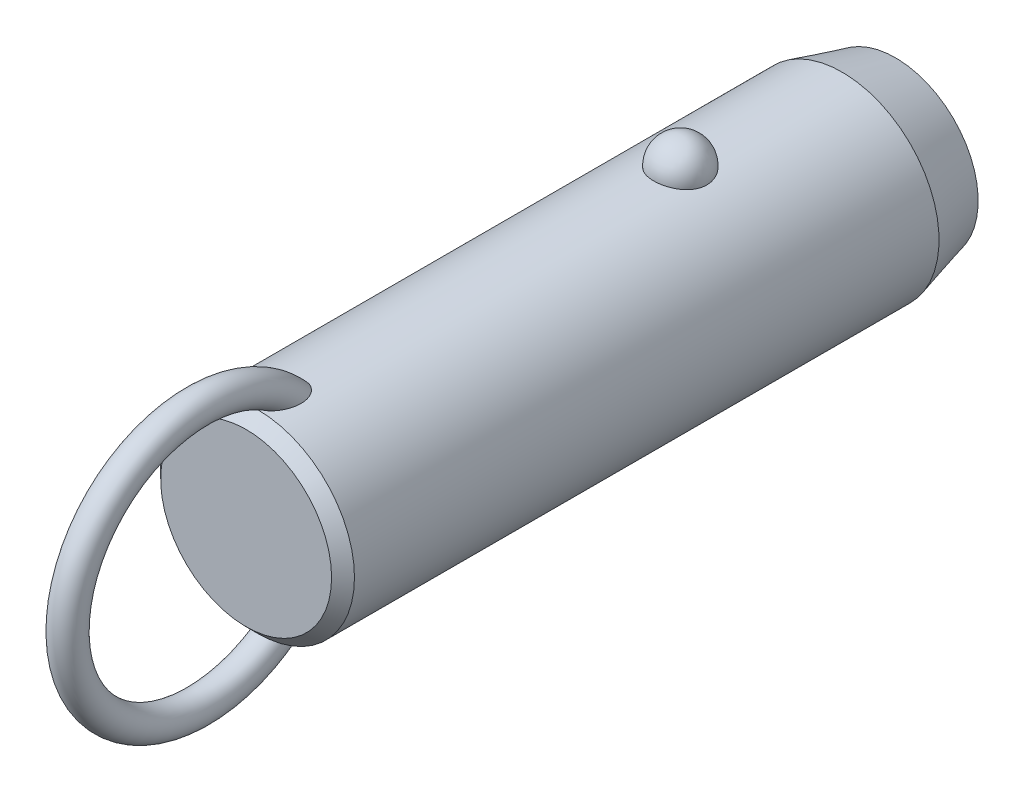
ISO-10303-21;
HEADER;
FILE_DESCRIPTION(('STEP AP214'),'2;1');
FILE_NAME('part.step','',(''),(''),'','','');
FILE_SCHEMA(('AUTOMOTIVE_DESIGN { 1 0 10303 214 1 1 1 1 }'));
ENDSEC;
DATA;
#1=APPLICATION_CONTEXT('core data for automotive mechanical design processes');
#2=APPLICATION_PROTOCOL_DEFINITION('international standard','automotive_design',2000,#1);
#3=PRODUCT_CONTEXT('',#1,'mechanical');
#4=PRODUCT('Part','Part','',(#3));
#5=PRODUCT_RELATED_PRODUCT_CATEGORY('part','',(#4));
#6=PRODUCT_DEFINITION_FORMATION('','',#4);
#7=PRODUCT_DEFINITION_CONTEXT('part definition',#1,'design');
#8=PRODUCT_DEFINITION('design','',#6,#7);
#9=PRODUCT_DEFINITION_SHAPE('','',#8);
#10=(LENGTH_UNIT() NAMED_UNIT(*) SI_UNIT(.MILLI.,.METRE.));
#11=(NAMED_UNIT(*) PLANE_ANGLE_UNIT() SI_UNIT($,.RADIAN.));
#12=(NAMED_UNIT(*) SI_UNIT($,.STERADIAN.) SOLID_ANGLE_UNIT());
#13=UNCERTAINTY_MEASURE_WITH_UNIT(LENGTH_MEASURE(1.E-05),#10,'distance_accuracy_value','');
#14=(GEOMETRIC_REPRESENTATION_CONTEXT(3) GLOBAL_UNCERTAINTY_ASSIGNED_CONTEXT((#13)) GLOBAL_UNIT_ASSIGNED_CONTEXT((#10,
#11,#12)) REPRESENTATION_CONTEXT('',''));
#15=CARTESIAN_POINT('',(0.,0.,0.));
#16=DIRECTION('',(0.,0.,1.));
#17=DIRECTION('',(1.,0.,0.));
#18=AXIS2_PLACEMENT_3D('',#15,#16,#17);
#19=CARTESIAN_POINT('',(0.,0.,40.7));
#20=DIRECTION('',(0.,0.,-1.));
#21=DIRECTION('',(-1.,0.,0.));
#22=AXIS2_PLACEMENT_3D('',#19,#20,#21);
#23=CYLINDRICAL_SURFACE('',#22,12.7);
#24=CARTESIAN_POINT('',(3.46661256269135,12.2177165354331,-3.5));
#25=CARTESIAN_POINT('',(3.4666090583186,12.2177194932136,-3.30432790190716));
#26=CARTESIAN_POINT('',(3.45063567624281,12.2222841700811,-3.10861112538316));
#27=CARTESIAN_POINT('',(3.38712451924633,12.2400345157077,-2.72271899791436));
#28=CARTESIAN_POINT('',(3.33957415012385,12.2532236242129,-2.53254588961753));
#29=CARTESIAN_POINT('',(3.2141234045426,12.286724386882,-2.16324948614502));
#30=CARTESIAN_POINT('',(3.13623639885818,12.3070329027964,-1.98412136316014));
#31=CARTESIAN_POINT('',(2.95205930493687,12.3525018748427,-1.64180592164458));
#32=CARTESIAN_POINT('',(2.84577003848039,12.3776621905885,-1.47861814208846));
#33=CARTESIAN_POINT('',(2.60688050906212,12.4301712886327,-1.17190583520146));
#34=CARTESIAN_POINT('',(2.47415697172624,12.4575299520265,-1.02847897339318));
#35=CARTESIAN_POINT('',(2.18615174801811,12.5112810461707,-0.766177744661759));
#36=CARTESIAN_POINT('',(2.03087002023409,12.5376734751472,-0.647303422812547));
#37=CARTESIAN_POINT('',(1.70237334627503,12.5864761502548,-0.437732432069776));
#38=CARTESIAN_POINT('',(1.52920948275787,12.6088972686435,-0.346958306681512));
#39=CARTESIAN_POINT('',(1.16944170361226,12.6473352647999,-0.195750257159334));
#40=CARTESIAN_POINT('',(0.982839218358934,12.663352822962,-0.135313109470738));
#41=CARTESIAN_POINT('',(0.604961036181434,12.6869706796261,-0.0473241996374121));
#42=CARTESIAN_POINT('',(0.41382314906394,12.6947125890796,-0.0192185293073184));
#43=CARTESIAN_POINT('',(0.0293827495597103,12.7014203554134,0.00517254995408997));
#44=CARTESIAN_POINT('',(-0.163919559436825,12.7003870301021,0.00146092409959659));
#45=CARTESIAN_POINT('',(-0.544374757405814,12.689735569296,-0.0373939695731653));
#46=CARTESIAN_POINT('',(-0.731575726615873,12.6802364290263,-0.0721015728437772));
#47=CARTESIAN_POINT('',(-1.09733277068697,12.6538333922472,-0.171364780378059));
#48=CARTESIAN_POINT('',(-1.27588869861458,12.6369293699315,-0.235920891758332));
#49=CARTESIAN_POINT('',(-1.6204698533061,12.5973946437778,-0.393548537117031));
#50=CARTESIAN_POINT('',(-1.78641865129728,12.5747321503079,-0.486778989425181));
#51=CARTESIAN_POINT('',(-2.10030671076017,12.5261316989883,-0.699110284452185));
#52=CARTESIAN_POINT('',(-2.24824419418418,12.5001934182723,-0.818213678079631));
#53=CARTESIAN_POINT('',(-2.52491489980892,12.4472906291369,-1.08157124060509));
#54=CARTESIAN_POINT('',(-2.65324222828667,12.4203160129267,-1.22624992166));
#55=CARTESIAN_POINT('',(-2.88410007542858,12.3687509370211,-1.53528325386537));
#56=CARTESIAN_POINT('',(-2.98662883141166,12.3441606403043,-1.69963924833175));
#57=CARTESIAN_POINT('',(-3.16432417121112,12.2998199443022,-2.04548497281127));
#58=CARTESIAN_POINT('',(-3.23917525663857,12.2801261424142,-2.22714424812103));
#59=CARTESIAN_POINT('',(-3.35800573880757,12.248167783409,-2.6009138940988));
#60=CARTESIAN_POINT('',(-3.4019860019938,12.2359030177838,-2.79302397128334));
#61=CARTESIAN_POINT('',(-3.45784812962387,12.2202347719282,-3.18140279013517));
#62=CARTESIAN_POINT('',(-3.46986123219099,12.2167950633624,-3.37765118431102));
#63=CARTESIAN_POINT('',(-3.46186273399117,12.2190638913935,-3.76943689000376));
#64=CARTESIAN_POINT('',(-3.44185196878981,12.2247721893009,-3.96497421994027));
#65=CARTESIAN_POINT('',(-3.37048652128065,12.2446381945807,-4.34881728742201));
#66=CARTESIAN_POINT('',(-3.31928253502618,12.2587552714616,-4.53715319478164));
#67=CARTESIAN_POINT('',(-3.18693461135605,12.2938237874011,-4.90231727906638));
#68=CARTESIAN_POINT('',(-3.1057895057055,12.3147754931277,-5.07914500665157));
#69=CARTESIAN_POINT('',(-2.91506431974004,12.3613125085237,-5.41732059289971));
#70=CARTESIAN_POINT('',(-2.80533587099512,12.3869217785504,-5.57858147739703));
#71=CARTESIAN_POINT('',(-2.560414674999,12.4398525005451,-5.88013283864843));
#72=CARTESIAN_POINT('',(-2.42522099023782,12.4671740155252,-6.02042254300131));
#73=CARTESIAN_POINT('',(-2.1323357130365,12.5205965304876,-6.27662798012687));
#74=CARTESIAN_POINT('',(-1.97456596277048,12.5466928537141,-6.39245542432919));
#75=CARTESIAN_POINT('',(-1.64115839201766,12.5946384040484,-6.59583547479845));
#76=CARTESIAN_POINT('',(-1.46552179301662,12.6164879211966,-6.68339001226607));
#77=CARTESIAN_POINT('',(-1.10356050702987,12.6532533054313,-6.82682153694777));
#78=CARTESIAN_POINT('',(-0.9173913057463,12.6682500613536,-6.88306988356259));
#79=CARTESIAN_POINT('',(-0.537836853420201,12.6900288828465,-6.96386887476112));
#80=CARTESIAN_POINT('',(-0.344452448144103,12.6968119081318,-6.9884232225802));
#81=CARTESIAN_POINT('',(0.0402577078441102,12.7013667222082,-7.00496469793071));
#82=CARTESIAN_POINT('',(0.231556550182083,12.6993008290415,-6.99753844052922));
#83=CARTESIAN_POINT('',(0.610105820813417,12.6867505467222,-6.95166366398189));
#84=CARTESIAN_POINT('',(0.797356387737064,12.6762664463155,-6.91321620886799));
#85=CARTESIAN_POINT('',(1.16186657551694,12.6480587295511,-6.80658431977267));
#86=CARTESIAN_POINT('',(1.33915951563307,12.6303611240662,-6.73850666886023));
#87=CARTESIAN_POINT('',(1.67968518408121,12.5896027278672,-6.57450875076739));
#88=CARTESIAN_POINT('',(1.84291705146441,12.5665416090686,-6.47858678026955));
#89=CARTESIAN_POINT('',(2.15340192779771,12.5171072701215,-6.25982455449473));
#90=CARTESIAN_POINT('',(2.30037831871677,12.4906895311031,-6.13660186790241));
#91=CARTESIAN_POINT('',(2.5717412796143,12.4376567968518,-5.86739587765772));
#92=CARTESIAN_POINT('',(2.69612388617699,12.4110417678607,-5.72140858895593));
#93=CARTESIAN_POINT('',(2.92107785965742,12.360051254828,-5.40794137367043));
#94=CARTESIAN_POINT('',(3.02121329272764,12.3357209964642,-5.24014110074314));
#95=CARTESIAN_POINT('',(3.19236291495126,12.2925446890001,-4.8896986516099));
#96=CARTESIAN_POINT('',(3.26338839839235,12.2736965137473,-4.70706226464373));
#97=CARTESIAN_POINT('',(3.36788038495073,12.245404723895,-4.35469510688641));
#98=CARTESIAN_POINT('',(3.40484026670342,12.2351018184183,-4.18605935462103));
#99=CARTESIAN_POINT('',(3.45420764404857,12.2212564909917,-3.84496058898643));
#100=CARTESIAN_POINT('',(3.46661565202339,12.2177139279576,-3.67249765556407));
#101=CARTESIAN_POINT('',(3.46661256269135,12.2177165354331,-3.5));
#102=B_SPLINE_CURVE_WITH_KNOTS('',3,(#24,#25,#26,#27,#28,#29,#30,#31,#32,#33,#34,#35,#36,#37,
#38,#39,#40,#41,#42,#43,#44,#45,#46,#47,#48,#49,#50,#51,#52,#53,#54,#55,#56,#57,#58,#59,#60,#61,
#62,#63,#64,#65,#66,#67,#68,#69,#70,#71,#72,#73,#74,#75,#76,#77,#78,#79,#80,#81,#82,#83,#84,#85,
#86,#87,#88,#89,#90,#91,#92,#93,#94,#95,#96,#97,#98,#99,#100,#101),.UNSPECIFIED.,.T.,.F.,(4,2,2,
2,2,2,2,2,2,2,2,2,2,2,2,2,2,2,2,2,2,2,2,2,2,2,2,2,2,2,2,2,2,2,2,2,2,2,4),(0.,0.586396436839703,
1.17302689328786,1.7593990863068,2.34575431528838,2.93491084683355,3.52406845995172,
4.11158733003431,4.69904375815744,5.2762784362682,5.85345931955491,6.42265312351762,
6.99185659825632,7.56427334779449,8.136746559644,8.71981013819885,9.3029135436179,
9.89247258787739,10.4820150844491,11.0691335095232,11.6562366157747,12.2405256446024,
12.8248374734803,13.412244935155,13.9996740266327,14.5891883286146,15.1786623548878,
15.7609861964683,16.3432419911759,16.9148635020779,17.4864654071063,18.0560241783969,
18.6256177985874,19.2037609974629,19.7820055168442,20.3699810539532,20.957728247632,
21.4746855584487,21.9916320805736),.UNSPECIFIED.);
#103=CARTESIAN_POINT('',(3.46661256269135,12.2177165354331,-3.5));
#104=VERTEX_POINT('',#103);
#105=EDGE_CURVE('E41',#104,#104,#102,.T.);
#106=ORIENTED_EDGE('',*,*,#105,.T.);
#107=EDGE_LOOP('',(#106));
#108=FACE_BOUND('',#107,.T.);
#109=CARTESIAN_POINT('',(0.,0.,51.9));
#110=DIRECTION('',(0.,0.,1.));
#111=DIRECTION('',(1.,0.,0.));
#112=AXIS2_PLACEMENT_3D('',#109,#110,#111);
#113=CIRCLE('',#112,12.7);
#114=CARTESIAN_POINT('',(12.7,0.,51.9));
#115=VERTEX_POINT('',#114);
#116=EDGE_CURVE('E10',#115,#115,#113,.F.);
#117=ORIENTED_EDGE('',*,*,#116,.T.);
#118=EDGE_LOOP('',(#117));
#119=FACE_BOUND('',#118,.T.);
#120=CARTESIAN_POINT('',(-0.54812224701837,-12.6881662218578,45.6432187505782));
#121=CARTESIAN_POINT('',(-0.648865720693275,-12.6838128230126,45.677926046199));
#122=CARTESIAN_POINT('',(-0.746398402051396,-12.6783867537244,45.7220428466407));
#123=CARTESIAN_POINT('',(-0.932125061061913,-12.666091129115,45.8267647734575));
#124=CARTESIAN_POINT('',(-1.02030388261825,-12.6592192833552,45.887396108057));
#125=CARTESIAN_POINT('',(-1.18487740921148,-12.6448747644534,46.021847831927));
#126=CARTESIAN_POINT('',(-1.26134296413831,-12.637406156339,46.0955825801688));
#127=CARTESIAN_POINT('',(-1.4023120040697,-12.6225412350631,46.2536045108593));
#128=CARTESIAN_POINT('',(-1.46681470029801,-12.6151449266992,46.3378923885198));
#129=CARTESIAN_POINT('',(-1.60714786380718,-12.5981718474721,46.5496577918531));
#130=CARTESIAN_POINT('',(-1.67725126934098,-12.588900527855,46.6809624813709));
#131=CARTESIAN_POINT('',(-1.79536591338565,-12.5725964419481,46.9532471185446));
#132=CARTESIAN_POINT('',(-1.84333535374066,-12.5655679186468,47.0942447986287));
#133=CARTESIAN_POINT('',(-1.93422576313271,-12.5519624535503,47.4376455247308));
#134=CARTESIAN_POINT('',(-1.96788773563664,-12.5466298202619,47.6425578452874));
#135=CARTESIAN_POINT('',(-1.9941399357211,-12.542463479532,47.9517600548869));
#136=CARTESIAN_POINT('',(-1.99883864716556,-12.5417153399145,48.0552987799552));
#137=CARTESIAN_POINT('',(-2.00078003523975,-12.5414074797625,48.2624512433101));
#138=CARTESIAN_POINT('',(-1.99802449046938,-12.5418474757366,48.3660649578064));
#139=CARTESIAN_POINT('',(-1.98336733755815,-12.5441750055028,48.6103207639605));
#140=CARTESIAN_POINT('',(-1.96851430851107,-12.5465291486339,48.750780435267));
#141=CARTESIAN_POINT('',(-1.92707089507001,-12.5529612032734,49.0299607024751));
#142=CARTESIAN_POINT('',(-1.900474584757,-12.5570399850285,49.1686803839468));
#143=CARTESIAN_POINT('',(-1.83619120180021,-12.5666008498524,49.4434113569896));
#144=CARTESIAN_POINT('',(-1.79850828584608,-12.57208240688,49.5794236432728));
#145=CARTESIAN_POINT('',(-1.71223796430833,-12.5841228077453,49.8478421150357));
#146=CARTESIAN_POINT('',(-1.66365679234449,-12.5906810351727,49.9802503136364));
#147=CARTESIAN_POINT('',(-1.57804503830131,-12.6016176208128,50.1854887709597));
#148=CARTESIAN_POINT('',(-1.54477252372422,-12.6057501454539,50.2599149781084));
#149=CARTESIAN_POINT('',(-1.47424480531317,-12.6141930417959,50.4068393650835));
#150=CARTESIAN_POINT('',(-1.43699041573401,-12.6185033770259,50.4793379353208));
#151=CARTESIAN_POINT('',(-1.35825795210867,-12.6272207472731,50.6218926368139));
#152=CARTESIAN_POINT('',(-1.31678520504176,-12.6316276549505,50.6919517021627));
#153=CARTESIAN_POINT('',(-1.22917793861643,-12.6404532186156,50.8290705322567));
#154=CARTESIAN_POINT('',(-1.18304514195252,-12.6448718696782,50.8961313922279));
#155=CARTESIAN_POINT('',(-1.07246411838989,-12.6547893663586,51.0438741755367));
#156=CARTESIAN_POINT('',(-1.00642239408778,-12.6602600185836,51.1233844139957));
#157=CARTESIAN_POINT('',(-0.864441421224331,-12.6707460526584,51.2731698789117));
#158=CARTESIAN_POINT('',(-0.788516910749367,-12.6757620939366,51.3434585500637));
#159=CARTESIAN_POINT('',(-0.652215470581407,-12.6833591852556,51.4486801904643));
#160=CARTESIAN_POINT('',(-0.594982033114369,-12.6861973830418,51.4876241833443));
#161=CARTESIAN_POINT('',(-0.475269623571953,-12.6912445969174,51.5564899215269));
#162=CARTESIAN_POINT('',(-0.412800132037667,-12.6934547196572,51.5864275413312));
#163=CARTESIAN_POINT('',(-0.295749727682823,-12.6966636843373,51.6297565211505));
#164=CARTESIAN_POINT('',(-0.241949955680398,-12.6978134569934,51.6452188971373));
#165=CARTESIAN_POINT('',(-0.132508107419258,-12.6994261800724,51.6668845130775));
#166=CARTESIAN_POINT('',(-0.0768679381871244,-12.6998898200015,51.6730970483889));
#167=CARTESIAN_POINT('',(0.0347696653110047,-12.7000752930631,51.6755838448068));
#168=CARTESIAN_POINT('',(0.0907676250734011,-12.6997954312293,51.6718353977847));
#169=CARTESIAN_POINT('',(0.201283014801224,-12.6985255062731,51.6547883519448));
#170=CARTESIAN_POINT('',(0.255799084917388,-12.6975348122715,51.6414812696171));
#171=CARTESIAN_POINT('',(0.376042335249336,-12.6946091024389,51.6020379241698));
#172=CARTESIAN_POINT('',(0.440950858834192,-12.6924943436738,51.5734492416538));
#173=CARTESIAN_POINT('',(0.565350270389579,-12.6875639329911,51.5063234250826));
#174=CARTESIAN_POINT('',(0.624828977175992,-12.6847467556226,51.4677646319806));
#175=CARTESIAN_POINT('',(0.774116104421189,-12.6767252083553,51.356949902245));
#176=CARTESIAN_POINT('',(0.859449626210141,-12.6711344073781,51.2787605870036));
#177=CARTESIAN_POINT('',(1.01789440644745,-12.6593922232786,51.110943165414));
#178=CARTESIAN_POINT('',(1.09096902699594,-12.653239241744,51.021282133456));
#179=CARTESIAN_POINT('',(1.22268793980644,-12.6411674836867,50.8402658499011));
#180=CARTESIAN_POINT('',(1.28193986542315,-12.6352572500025,50.749345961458));
#181=CARTESIAN_POINT('',(1.39259777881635,-12.6235401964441,50.5627929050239));
#182=CARTESIAN_POINT('',(1.44399707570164,-12.6177334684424,50.4671558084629));
#183=CARTESIAN_POINT('',(1.53972870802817,-12.6064093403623,50.2722738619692));
#184=CARTESIAN_POINT('',(1.58405262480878,-12.6008922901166,50.1730248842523));
#185=CARTESIAN_POINT('',(1.66600705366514,-12.5903187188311,49.9717727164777));
#186=CARTESIAN_POINT('',(1.70363651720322,-12.5852622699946,49.8697690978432));
#187=CARTESIAN_POINT('',(1.7754537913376,-12.5753406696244,49.6543580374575));
#188=CARTESIAN_POINT('',(1.80903453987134,-12.5705328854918,49.5407454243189));
#189=CARTESIAN_POINT('',(1.86844163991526,-12.5618400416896,49.3114575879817));
#190=CARTESIAN_POINT('',(1.89426665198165,-12.5579551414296,49.1957820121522));
#191=CARTESIAN_POINT('',(1.93785464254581,-12.5513030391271,48.9630072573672));
#192=CARTESIAN_POINT('',(1.95562640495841,-12.5485346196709,48.8459097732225));
#193=CARTESIAN_POINT('',(1.98264463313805,-12.5442934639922,48.6107473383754));
#194=CARTESIAN_POINT('',(1.99189298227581,-12.5428204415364,48.4926826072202));
#195=CARTESIAN_POINT('',(2.00416068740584,-12.540871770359,48.1806225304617));
#196=CARTESIAN_POINT('',(1.99944433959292,-12.541631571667,47.986229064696));
#197=CARTESIAN_POINT('',(1.96113755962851,-12.5476846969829,47.6003095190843));
#198=CARTESIAN_POINT('',(1.92758341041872,-12.5529723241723,47.4087801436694));
#199=CARTESIAN_POINT('',(1.83934342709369,-12.5661532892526,47.0822728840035));
#200=CARTESIAN_POINT('',(1.79215440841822,-12.5730485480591,46.9452499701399));
#201=CARTESIAN_POINT('',(1.67676242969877,-12.588958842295,46.6804459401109));
#202=CARTESIAN_POINT('',(1.60859050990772,-12.597970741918,46.5526515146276));
#203=CARTESIAN_POINT('',(1.4658383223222,-12.6152829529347,46.3358006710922));
#204=CARTESIAN_POINT('',(1.39525727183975,-12.6233659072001,46.2441050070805));
#205=CARTESIAN_POINT('',(1.2399259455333,-12.6395676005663,46.0734854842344));
#206=CARTESIAN_POINT('',(1.15517932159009,-12.6476863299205,45.9945583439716));
#207=CARTESIAN_POINT('',(0.971995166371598,-12.6630846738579,45.8526438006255));
#208=CARTESIAN_POINT('',(0.873456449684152,-12.6703572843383,45.789784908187));
#209=CARTESIAN_POINT('',(0.665847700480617,-12.6829569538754,45.6844870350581));
#210=CARTESIAN_POINT('',(0.55678457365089,-12.688285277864,45.6420347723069));
#211=CARTESIAN_POINT('',(0.347338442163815,-12.6956226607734,45.5844434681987));
#212=CARTESIAN_POINT('',(0.247759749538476,-12.6979816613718,45.5663996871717));
#213=CARTESIAN_POINT('',(0.0470218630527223,-12.7003077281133,45.5486007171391));
#214=CARTESIAN_POINT('',(-0.0541350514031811,-12.7002779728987,45.5488212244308));
#215=CARTESIAN_POINT('',(-0.221414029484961,-12.6982482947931,45.5643639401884));
#216=CARTESIAN_POINT('',(-0.288055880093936,-12.6969033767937,45.5746662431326));
#217=CARTESIAN_POINT('',(-0.419599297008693,-12.6932369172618,45.6031348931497));
#218=CARTESIAN_POINT('',(-0.484501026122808,-12.6909154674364,45.6213005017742));
#219=CARTESIAN_POINT('',(-0.54812224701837,-12.6881662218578,45.6432187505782));
#220=B_SPLINE_CURVE_WITH_KNOTS('',3,(#120,#121,#122,#123,#124,#125,#126,#127,#128,#129,#130,
#131,#132,#133,#134,#135,#136,#137,#138,#139,#140,#141,#142,#143,#144,#145,#146,#147,#148,#149,
#150,#151,#152,#153,#154,#155,#156,#157,#158,#159,#160,#161,#162,#163,#164,#165,#166,#167,#168,
#169,#170,#171,#172,#173,#174,#175,#176,#177,#178,#179,#180,#181,#182,#183,#184,#185,#186,#187,
#188,#189,#190,#191,#192,#193,#194,#195,#196,#197,#198,#199,#200,#201,#202,#203,#204,#205,#206,
#207,#208,#209,#210,#211,#212,#213,#214,#215,#216,#217,#218,#219),.UNSPECIFIED.,.T.,.F.,(4,2,2,
2,2,2,2,2,2,2,2,2,2,2,2,2,2,2,2,2,2,2,2,2,2,2,2,2,2,2,2,2,2,2,2,2,2,2,2,2,2,2,2,2,2,2,2,2,2,4),
(0.,0.319642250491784,0.639794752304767,0.957927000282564,1.27608021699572,1.72100165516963,
2.16675988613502,2.78630021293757,3.09705782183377,3.40774128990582,3.83096358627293,
4.25439969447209,4.67767724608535,5.10071330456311,5.34550297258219,5.59024267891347,
5.8346770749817,6.07902143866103,6.38891080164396,6.69834321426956,6.90560910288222,
7.11250749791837,7.27977315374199,7.44687060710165,7.6143493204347,7.78197685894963,
7.99365544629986,8.20579780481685,8.551473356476,8.89816429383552,9.22375138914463,
9.54961437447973,9.87586224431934,10.202161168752,10.5575872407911,10.9130746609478,
11.2681734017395,11.6231936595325,12.2046601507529,12.7853961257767,13.219164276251,
13.6522938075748,13.9989174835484,14.3454519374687,14.6946768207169,15.0436740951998,
15.3457513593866,15.6474266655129,15.8493051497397,16.0511646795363),.UNSPECIFIED.);
#221=CARTESIAN_POINT('',(-0.54812224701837,-12.6881662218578,45.6432187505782));
#222=VERTEX_POINT('',#221);
#223=EDGE_CURVE('E59',#222,#222,#220,.T.);
#224=ORIENTED_EDGE('',*,*,#223,.T.);
#225=EDGE_LOOP('',(#224));
#226=FACE_BOUND('',#225,.T.);
#227=CARTESIAN_POINT('',(-0.54812224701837,12.6881662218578,45.6432187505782));
#228=CARTESIAN_POINT('',(-0.459436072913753,12.6919968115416,45.612673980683));
#229=CARTESIAN_POINT('',(-0.368189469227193,12.6949996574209,45.5893913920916));
#230=CARTESIAN_POINT('',(-0.183024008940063,12.6990186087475,45.5584062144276));
#231=CARTESIAN_POINT('',(-0.0891049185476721,12.7000345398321,45.5507049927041));
#232=CARTESIAN_POINT('',(0.098714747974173,12.6999636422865,45.5512455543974));
#233=CARTESIAN_POINT('',(0.192615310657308,12.6988761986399,45.5594920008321));
#234=CARTESIAN_POINT('',(0.377658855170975,12.6947211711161,45.5915515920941));
#235=CARTESIAN_POINT('',(0.468801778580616,12.6916535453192,45.6153650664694));
#236=CARTESIAN_POINT('',(0.645809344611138,12.6838788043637,45.6774565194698));
#237=CARTESIAN_POINT('',(0.731679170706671,12.6791733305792,45.715720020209));
#238=CARTESIAN_POINT('',(0.896315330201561,12.6686004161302,45.805120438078));
#239=CARTESIAN_POINT('',(0.975080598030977,12.6627328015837,45.8562592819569));
#240=CARTESIAN_POINT('',(1.12963655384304,12.6499161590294,45.9736782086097));
#241=CARTESIAN_POINT('',(1.20478673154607,12.6429194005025,46.0407929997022));
#242=CARTESIAN_POINT('',(1.34448241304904,12.6288282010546,46.1852250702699));
#243=CARTESIAN_POINT('',(1.40902173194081,12.621733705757,46.2625482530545));
#244=CARTESIAN_POINT('',(1.55208211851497,12.6050877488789,46.4592475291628));
#245=CARTESIAN_POINT('',(1.62510490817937,12.5957546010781,46.5826540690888));
#246=CARTESIAN_POINT('',(1.7501904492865,12.5789823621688,46.8397690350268));
#247=CARTESIAN_POINT('',(1.80221377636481,12.5715468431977,46.973496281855));
#248=CARTESIAN_POINT('',(1.90309965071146,12.5567434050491,47.2983516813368));
#249=CARTESIAN_POINT('',(1.94342317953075,12.5504515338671,47.4921611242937));
#250=CARTESIAN_POINT('',(1.99332997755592,12.5426147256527,47.8837881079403));
#251=CARTESIAN_POINT('',(2.00285305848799,12.5410790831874,48.0816127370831));
#252=CARTESIAN_POINT('',(1.99678999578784,12.5420407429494,48.4166427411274));
#253=CARTESIAN_POINT('',(1.98794117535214,12.5434564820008,48.5540428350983));
#254=CARTESIAN_POINT('',(1.95865119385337,12.5480641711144,48.8276394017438));
#255=CARTESIAN_POINT('',(1.9382043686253,12.5512569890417,48.9638352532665));
#256=CARTESIAN_POINT('',(1.88647896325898,12.5591352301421,49.2342493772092));
#257=CARTESIAN_POINT('',(1.85518800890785,12.5638223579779,49.3684652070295));
#258=CARTESIAN_POINT('',(1.78217886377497,12.5743868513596,49.6339362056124));
#259=CARTESIAN_POINT('',(1.74046509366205,12.5802637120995,49.7651926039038));
#260=CARTESIAN_POINT('',(1.66024095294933,12.5910571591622,49.9860855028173));
#261=CARTESIAN_POINT('',(1.62434772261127,12.5957535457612,50.0766904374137));
#262=CARTESIAN_POINT('',(1.5470900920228,12.6054762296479,50.2555125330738));
#263=CARTESIAN_POINT('',(1.50572681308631,12.6105024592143,50.3437301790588));
#264=CARTESIAN_POINT('',(1.41728020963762,12.620748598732,50.5169321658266));
#265=CARTESIAN_POINT('',(1.37021377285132,12.625967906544,50.6019251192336));
#266=CARTESIAN_POINT('',(1.2696962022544,12.6364721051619,50.7680072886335));
#267=CARTESIAN_POINT('',(1.21624929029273,12.6417569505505,50.8490990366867));
#268=CARTESIAN_POINT('',(1.10304413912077,12.6521331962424,51.0047027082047));
#269=CARTESIAN_POINT('',(1.04340936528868,12.657226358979,51.0793033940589));
#270=CARTESIAN_POINT('',(0.915919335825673,12.6670906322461,51.221324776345));
#271=CARTESIAN_POINT('',(0.848064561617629,12.6718617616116,51.2887458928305));
#272=CARTESIAN_POINT('',(0.717035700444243,12.67987711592,51.4006247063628));
#273=CARTESIAN_POINT('',(0.655526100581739,12.6832377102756,51.4469970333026));
#274=CARTESIAN_POINT('',(0.525985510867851,12.6892676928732,51.5296195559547));
#275=CARTESIAN_POINT('',(0.457969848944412,12.6919386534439,51.5658927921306));
#276=CARTESIAN_POINT('',(0.33485964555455,12.695691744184,51.6166572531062));
#277=CARTESIAN_POINT('',(0.281116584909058,12.6970073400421,51.6343733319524));
#278=CARTESIAN_POINT('',(0.171425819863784,12.6989609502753,51.6606429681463));
#279=CARTESIAN_POINT('',(0.115480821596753,12.699599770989,51.6692074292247));
#280=CARTESIAN_POINT('',(0.0027261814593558,12.7001251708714,51.6762531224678));
#281=CARTESIAN_POINT('',(-0.054085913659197,12.7000089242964,51.6746964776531));
#282=CARTESIAN_POINT('',(-0.166544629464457,12.6990328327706,51.6616005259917));
#283=CARTESIAN_POINT('',(-0.22219029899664,12.6981724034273,51.6500533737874));
#284=CARTESIAN_POINT('',(-0.342018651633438,12.695562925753,51.6149128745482));
#285=CARTESIAN_POINT('',(-0.405606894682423,12.6936676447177,51.5893322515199));
#286=CARTESIAN_POINT('',(-0.527815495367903,12.6891754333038,51.5283111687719));
#287=CARTESIAN_POINT('',(-0.586425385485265,12.6865770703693,51.4928505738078));
#288=CARTESIAN_POINT('',(-0.731842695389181,12.6792129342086,51.3914960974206));
#289=CARTESIAN_POINT('',(-0.814709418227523,12.6740767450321,51.3200395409));
#290=CARTESIAN_POINT('',(-0.969101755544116,12.6632083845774,51.1658900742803));
#291=CARTESIAN_POINT('',(-1.04059564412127,12.6574746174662,51.0831668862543));
#292=CARTESIAN_POINT('',(-1.1698111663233,12.6461638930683,50.9158096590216));
#293=CARTESIAN_POINT('',(-1.2281136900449,12.6405994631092,50.8316166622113));
#294=CARTESIAN_POINT('',(-1.33743405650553,12.6295007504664,50.6585791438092));
#295=CARTESIAN_POINT('',(-1.38844577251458,12.6239664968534,50.5697307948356));
#296=CARTESIAN_POINT('',(-1.48400702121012,12.6130898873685,50.3883895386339));
#297=CARTESIAN_POINT('',(-1.52854232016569,12.6077479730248,50.2958891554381));
#298=CARTESIAN_POINT('',(-1.61150113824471,12.5974127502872,50.1081607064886));
#299=CARTESIAN_POINT('',(-1.64992317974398,12.5924195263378,50.0129319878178));
#300=CARTESIAN_POINT('',(-1.73468589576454,12.581070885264,49.7828936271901));
#301=CARTESIAN_POINT('',(-1.77831261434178,12.5749388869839,49.6470661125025));
#302=CARTESIAN_POINT('',(-1.85439734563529,12.5639437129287,49.3722128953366));
#303=CARTESIAN_POINT('',(-1.88684994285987,12.5590811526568,49.2331856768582));
#304=CARTESIAN_POINT('',(-1.9400848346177,12.550968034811,48.9530923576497));
#305=CARTESIAN_POINT('',(-1.96088706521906,12.5477147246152,48.8120301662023));
#306=CARTESIAN_POINT('',(-1.99000539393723,12.5431291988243,48.5286689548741));
#307=CARTESIAN_POINT('',(-1.99832911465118,12.5417958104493,48.3863707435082));
#308=CARTESIAN_POINT('',(-2.00166624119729,12.5412674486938,48.0576271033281));
#309=CARTESIAN_POINT('',(-1.99178843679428,12.5428579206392,47.871088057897));
#310=CARTESIAN_POINT('',(-1.94455183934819,12.5502731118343,47.5016240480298));
#311=CARTESIAN_POINT('',(-1.90724032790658,12.5560905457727,47.3186934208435));
#312=CARTESIAN_POINT('',(-1.81330718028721,12.5699462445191,47.0048488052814));
#313=CARTESIAN_POINT('',(-1.76338820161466,12.5771273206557,46.8719105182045));
#314=CARTESIAN_POINT('',(-1.6430501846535,12.593414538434,46.6156813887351));
#315=CARTESIAN_POINT('',(-1.57265346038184,12.6025185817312,46.492380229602));
#316=CARTESIAN_POINT('',(-1.42634956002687,12.6198178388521,46.2835648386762));
#317=CARTESIAN_POINT('',(-1.35423772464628,12.6278405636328,46.1953846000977));
#318=CARTESIAN_POINT('',(-1.19645664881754,12.6437632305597,46.0321079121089));
#319=CARTESIAN_POINT('',(-1.11080536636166,12.6516633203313,45.9569944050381));
#320=CARTESIAN_POINT('',(-0.947219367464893,12.6648319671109,45.8378114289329));
#321=CARTESIAN_POINT('',(-0.871624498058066,12.670300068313,45.7905414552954));
#322=CARTESIAN_POINT('',(-0.71416188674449,12.6801492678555,45.7077413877));
#323=CARTESIAN_POINT('',(-0.6322953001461,12.684530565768,45.6722091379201));
#324=CARTESIAN_POINT('',(-0.54812224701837,12.6881662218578,45.6432187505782));
#325=B_SPLINE_CURVE_WITH_KNOTS('',3,(#227,#228,#229,#230,#231,#232,#233,#234,#235,#236,#237,
#238,#239,#240,#241,#242,#243,#244,#245,#246,#247,#248,#249,#250,#251,#252,#253,#254,#255,#256,
#257,#258,#259,#260,#261,#262,#263,#264,#265,#266,#267,#268,#269,#270,#271,#272,#273,#274,#275,
#276,#277,#278,#279,#280,#281,#282,#283,#284,#285,#286,#287,#288,#289,#290,#291,#292,#293,#294,
#295,#296,#297,#298,#299,#300,#301,#302,#303,#304,#305,#306,#307,#308,#309,#310,#311,#312,#313,
#314,#315,#316,#317,#318,#319,#320,#321,#322,#323,#324),.UNSPECIFIED.,.T.,.F.,(4,2,2,2,2,2,2,2,
2,2,2,2,2,2,2,2,2,2,2,2,2,2,2,2,2,2,2,2,2,2,2,2,2,2,2,2,2,2,2,2,2,2,2,2,2,2,2,2,4),(0.,
0.281328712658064,0.562682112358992,0.844117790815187,1.12555942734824,1.40671982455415,
1.68792232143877,1.98972294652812,2.2916988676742,2.72039860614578,3.14989948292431,
3.7408491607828,4.33295293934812,4.74554109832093,5.15833092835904,5.57159335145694,
5.98468079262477,6.27722775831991,6.56971484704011,6.86135609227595,7.1528054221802,
7.43927407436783,7.72572595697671,7.9563586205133,8.18646071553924,8.35559393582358,
8.52452541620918,8.69408946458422,8.86378678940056,9.06834348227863,9.27332014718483,
9.60010414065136,9.9277843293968,10.2350252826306,10.5425229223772,10.8506864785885,
11.1589244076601,11.5867893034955,12.0148612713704,12.4421984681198,12.8692745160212,
13.4279365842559,13.9856380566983,14.4107062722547,14.8353130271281,15.1765567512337,
15.5173516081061,15.7844129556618,16.051425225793),.UNSPECIFIED.);
#326=CARTESIAN_POINT('',(-0.54812224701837,12.6881662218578,45.6432187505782));
#327=VERTEX_POINT('',#326);
#328=EDGE_CURVE('E66',#327,#327,#325,.T.);
#329=ORIENTED_EDGE('',*,*,#328,.T.);
#330=EDGE_LOOP('',(#329));
#331=FACE_BOUND('',#330,.T.);
#332=CARTESIAN_POINT('',(0.,0.,-24.6999999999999));
#333=DIRECTION('',(0.,0.,-1.));
#334=DIRECTION('',(-1.,0.,0.));
#335=AXIS2_PLACEMENT_3D('',#332,#333,#334);
#336=CIRCLE('',#335,12.7);
#337=CARTESIAN_POINT('',(-12.7,0.,-24.6999999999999));
#338=VERTEX_POINT('',#337);
#339=EDGE_CURVE('E56',#338,#338,#336,.F.);
#340=ORIENTED_EDGE('',*,*,#339,.T.);
#341=EDGE_LOOP('',(#340));
#342=FACE_BOUND('',#341,.T.);
#343=ADVANCED_FACE('F37',(#108,#119,#226,#331,#342),#23,.T.);
#344=CARTESIAN_POINT('',(0.,0.,-31.7));
#345=DIRECTION('',(0.,0.,-1.));
#346=DIRECTION('',(-1.,0.,0.));
#347=AXIS2_PLACEMENT_3D('',#344,#345,#346);
#348=PLANE('',#347);
#349=CARTESIAN_POINT('',(0.,0.,-31.7));
#350=DIRECTION('',(0.,0.,-1.));
#351=DIRECTION('',(-1.,0.,0.));
#352=AXIS2_PLACEMENT_3D('',#349,#350,#351);
#353=CIRCLE('',#352,10.8243556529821);
#354=CARTESIAN_POINT('',(-10.8243556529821,0.,-31.7));
#355=VERTEX_POINT('',#354);
#356=EDGE_CURVE('E65',#355,#355,#353,.T.);
#357=ORIENTED_EDGE('',*,*,#356,.T.);
#358=EDGE_LOOP('',(#357));
#359=FACE_BOUND('',#358,.T.);
#360=ADVANCED_FACE('F84',(#359),#348,.T.);
#361=CARTESIAN_POINT('',(0.,0.,-31.7));
#362=DIRECTION('',(0.,0.,1.));
#363=DIRECTION('',(1.,0.,0.));
#364=AXIS2_PLACEMENT_3D('',#361,#362,#363);
#365=CONICAL_SURFACE('',#364,10.8243556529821,0.261799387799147);
#366=ORIENTED_EDGE('',*,*,#339,.F.);
#367=EDGE_LOOP('',(#366));
#368=FACE_BOUND('',#367,.T.);
#369=ORIENTED_EDGE('',*,*,#356,.F.);
#370=EDGE_LOOP('',(#369));
#371=FACE_BOUND('',#370,.T.);
#372=ADVANCED_FACE('F82',(#368,#371),#365,.T.);
#373=CARTESIAN_POINT('',(0.,0.,53.4));
#374=DIRECTION('',(0.,0.,1.));
#375=DIRECTION('',(1.,0.,0.));
#376=AXIS2_PLACEMENT_3D('',#373,#374,#375);
#377=PLANE('',#376);
#378=CARTESIAN_POINT('',(0.,0.,53.4));
#379=DIRECTION('',(0.,0.,1.));
#380=DIRECTION('',(1.,0.,0.));
#381=AXIS2_PLACEMENT_3D('',#378,#379,#380);
#382=CIRCLE('',#381,11.2);
#383=CARTESIAN_POINT('',(11.2,0.,53.4));
#384=VERTEX_POINT('',#383);
#385=EDGE_CURVE('E50',#384,#384,#382,.T.);
#386=ORIENTED_EDGE('',*,*,#385,.T.);
#387=EDGE_LOOP('',(#386));
#388=FACE_BOUND('',#387,.T.);
#389=ADVANCED_FACE('F76',(#388),#377,.T.);
#390=CARTESIAN_POINT('',(0.,0.,59.75));
#391=DIRECTION('',(1.,0.,0.));
#392=DIRECTION('',(0.,0.,-1.));
#393=AXIS2_PLACEMENT_3D('',#390,#391,#392);
#394=TOROIDAL_SURFACE('',#393,17.05,2.);
#395=ORIENTED_EDGE('',*,*,#328,.F.);
#396=EDGE_LOOP('',(#395));
#397=FACE_BOUND('',#396,.T.);
#398=ORIENTED_EDGE('',*,*,#223,.F.);
#399=EDGE_LOOP('',(#398));
#400=FACE_BOUND('',#399,.T.);
#401=ADVANCED_FACE('F72',(#397,#400),#394,.T.);
#402=CARTESIAN_POINT('',(0.,0.,53.4));
#403=DIRECTION('',(0.,0.,-1.));
#404=DIRECTION('',(-1.,0.,0.));
#405=AXIS2_PLACEMENT_3D('',#402,#403,#404);
#406=CONICAL_SURFACE('',#405,11.2,0.785398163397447);
#407=ORIENTED_EDGE('',*,*,#116,.F.);
#408=EDGE_LOOP('',(#407));
#409=FACE_BOUND('',#408,.T.);
#410=ORIENTED_EDGE('',*,*,#385,.F.);
#411=EDGE_LOOP('',(#410));
#412=FACE_BOUND('',#411,.T.);
#413=ADVANCED_FACE('F39',(#409,#412),#406,.T.);
#414=CARTESIAN_POINT('',(0.,12.7,-3.5));
#415=DIRECTION('',(0.,1.,0.));
#416=DIRECTION('',(0.,0.,-1.));
#417=AXIS2_PLACEMENT_3D('',#414,#415,#416);
#418=SPHERICAL_SURFACE('',#417,3.5);
#419=ORIENTED_EDGE('',*,*,#105,.F.);
#420=EDGE_LOOP('',(#419));
#421=FACE_BOUND('',#420,.T.);
#422=ADVANCED_FACE('F78',(#421),#418,.T.);
#423=CLOSED_SHELL('',(#343,#360,#372,#389,#401,#413,#422));
#424=MANIFOLD_SOLID_BREP('B2',#423);
#425=ADVANCED_BREP_SHAPE_REPRESENTATION('',(#18,#424),#14);
#426=SHAPE_DEFINITION_REPRESENTATION(#9,#425);
ENDSEC;
END-ISO-10303-21;
